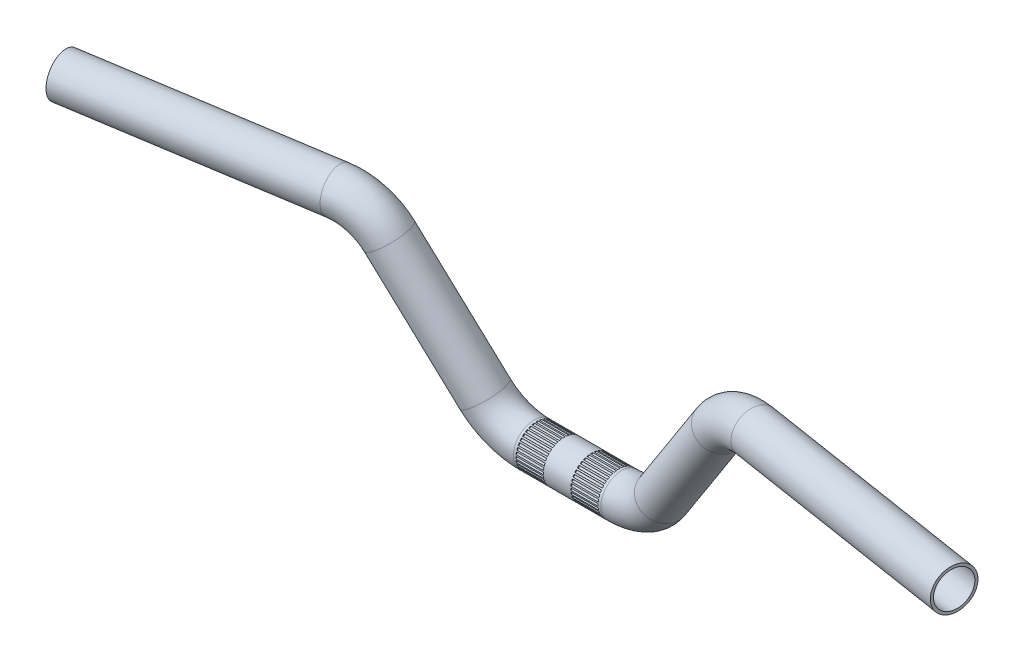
from build123d import *

# Parameters (mm, degrees)
SKETCH4_R                = 19
SKETCH4_R_2              = 16.5
CUT_EXTRUDE1_START       = 12.5
SKETCH11_R               = 1
CUT_EXTRUDE1_DEPTH       = 25
CIRPATTERN1_COUNT        = 36
MIRROR2_START            = 12.5
MIRROR2_COPY_1_SKETCH_R  = 1
MIRROR2_COPY_1_DEPTH     = 25
MIRROR2_COPY_2_SKETCH_R  = 1
MIRROR2_COPY_2_DEPTH     = 25
MIRROR2_COPY_3_SKETCH_R  = 1
MIRROR2_COPY_3_DEPTH     = 25
MIRROR2_COPY_4_SKETCH_R  = 1
MIRROR2_COPY_4_DEPTH     = 25
MIRROR2_COPY_5_SKETCH_R  = 1
MIRROR2_COPY_5_DEPTH     = 25
MIRROR2_COPY_6_SKETCH_R  = 1
MIRROR2_COPY_6_DEPTH     = 25
MIRROR2_COPY_7_SKETCH_R  = 1
MIRROR2_COPY_7_DEPTH     = 25
MIRROR2_COPY_8_SKETCH_R  = 1
MIRROR2_COPY_8_DEPTH     = 25
MIRROR2_COPY_9_SKETCH_R  = 1
MIRROR2_COPY_9_DEPTH     = 25
MIRROR2_COPY_10_SKETCH_R = 1
MIRROR2_COPY_10_DEPTH    = 25
MIRROR2_COPY_11_SKETCH_R = 1
MIRROR2_COPY_11_DEPTH    = 25
MIRROR2_COPY_12_SKETCH_R = 1
MIRROR2_COPY_12_DEPTH    = 25
MIRROR2_COPY_13_SKETCH_R = 1
MIRROR2_COPY_13_DEPTH    = 25
MIRROR2_COPY_14_SKETCH_R = 1
MIRROR2_COPY_14_DEPTH    = 25
MIRROR2_COPY_15_SKETCH_R = 1
MIRROR2_COPY_15_DEPTH    = 25
MIRROR2_COPY_16_SKETCH_R = 1
MIRROR2_COPY_16_DEPTH    = 25
MIRROR2_COPY_17_SKETCH_R = 1
MIRROR2_COPY_17_DEPTH    = 25
MIRROR2_COPY_18_SKETCH_R = 1
MIRROR2_COPY_18_DEPTH    = 25
MIRROR2_COPY_19_SKETCH_R = 1
MIRROR2_COPY_19_DEPTH    = 25
MIRROR2_COPY_20_SKETCH_R = 1
MIRROR2_COPY_20_DEPTH    = 25
MIRROR2_COPY_21_SKETCH_R = 1
MIRROR2_COPY_21_DEPTH    = 25
MIRROR2_COPY_22_SKETCH_R = 1
MIRROR2_COPY_22_DEPTH    = 25
MIRROR2_COPY_23_SKETCH_R = 1
MIRROR2_COPY_23_DEPTH    = 25
MIRROR2_COPY_24_SKETCH_R = 1
MIRROR2_COPY_24_DEPTH    = 25
MIRROR2_COPY_25_SKETCH_R = 1
MIRROR2_COPY_25_DEPTH    = 25
MIRROR2_COPY_26_SKETCH_R = 1
MIRROR2_COPY_26_DEPTH    = 25
MIRROR2_COPY_27_SKETCH_R = 1
MIRROR2_COPY_27_DEPTH    = 25
MIRROR2_COPY_28_SKETCH_R = 1
MIRROR2_COPY_28_DEPTH    = 25
MIRROR2_COPY_29_SKETCH_R = 1
MIRROR2_COPY_29_DEPTH    = 25
MIRROR2_COPY_30_SKETCH_R = 1
MIRROR2_COPY_30_DEPTH    = 25
MIRROR2_COPY_31_SKETCH_R = 1
MIRROR2_COPY_31_DEPTH    = 25
MIRROR2_COPY_32_SKETCH_R = 1
MIRROR2_COPY_32_DEPTH    = 25
MIRROR2_COPY_33_SKETCH_R = 1
MIRROR2_COPY_33_DEPTH    = 25
MIRROR2_COPY_34_SKETCH_R = 1
MIRROR2_COPY_34_DEPTH    = 25
MIRROR2_COPY_35_SKETCH_R = 1
MIRROR2_COPY_35_DEPTH    = 25


with BuildPart() as part:
    # Sweep-Thin1: sweep along a curve in space
    with BuildLine() as sweep_thin1_path:
        Line((0, 0, 0), (39.884500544, 0, 0))
        ThreePointArc((80.920548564, 21.099765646, 3.767815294), (63.032685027, 5.592668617, 0.998690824), (39.884500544, 0, 0))
        Line((80.920548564, 21.099765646, 3.767815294), (150.423374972, 119.386590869, 21.319034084))
        ThreePointArc((190.202166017, 140, 28.973785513), (167.809892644, 134.548845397, 25.07743527), (150.423374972, 119.386590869, 21.319034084))
        Line((190.202166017, 140, 28.973785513), (406, 140, 63))
    # Sketch4 → Sweep-Thin1 (sweep)
    with BuildSketch(Plane(origin=(0, 0, 0), x_dir=(0, 0, -1), z_dir=(1, 0, 0))):
        Circle(SKETCH4_R)
        Circle(SKETCH4_R_2, mode=Mode.SUBTRACT)
    sweep_thin1 = sweep(path=sweep_thin1_path.line)

    # Mirror1: Sweep-Thin1 across plane
    add(sweep_thin1.mirror(Plane(origin=(0, 0, 0), x_dir=(0, 0, 1), z_dir=(1, 0, 0))))

    # Sketch11 → Cut-Extrude1 (cut)
    with BuildSketch(Plane(origin=(0, 0, 0), x_dir=(0, 0, -1), z_dir=(1, 0, 0)).offset(CUT_EXTRUDE1_START)):
        with Locations((0, -19)):
            Circle(SKETCH11_R)
    cut_extrude1 = extrude(amount=CUT_EXTRUDE1_DEPTH, mode=Mode.SUBTRACT)

    # CirPattern1: Cut-Extrude1 ×36 about axis
    cirpattern1_axis = Axis((0, 0, 0), (1, 0, 0))
    for i in range(1, CIRPATTERN1_COUNT):
        add(cut_extrude1.rotate(cirpattern1_axis, i * 360 / CIRPATTERN1_COUNT), mode=Mode.SUBTRACT)

    # Mirror2: Cut-Extrude1 across plane
    add(cut_extrude1.mirror(Plane(origin=(0, 0, 0), x_dir=(0, 0, 1), z_dir=(1, 0, 0))), mode=Mode.SUBTRACT)

    # Mirror2 copy 1 sketch → Mirror2 copy 1 (cut)
    with BuildSketch(Plane(origin=(0, 0, 0), x_dir=(0, 0.17364817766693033, -0.984807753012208), z_dir=(-1, 0, 0)).offset(MIRROR2_START)):
        with Locations((0, 19)):
            Circle(MIRROR2_COPY_1_SKETCH_R)
    extrude(amount=MIRROR2_COPY_1_DEPTH, mode=Mode.SUBTRACT)

    # Mirror2 copy 2 sketch → Mirror2 copy 2 (cut)
    with BuildSketch(Plane(origin=(0, 0, 0), x_dir=(0, 0.3420201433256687, -0.9396926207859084), z_dir=(-1, 0, 0)).offset(MIRROR2_START)):
        with Locations((0, 19)):
            Circle(MIRROR2_COPY_2_SKETCH_R)
    extrude(amount=MIRROR2_COPY_2_DEPTH, mode=Mode.SUBTRACT)

    # Mirror2 copy 3 sketch → Mirror2 copy 3 (cut)
    with BuildSketch(Plane(origin=(0, 0, 0), x_dir=(0, 0.49999999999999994, -0.8660254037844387), z_dir=(-1, 0, 0)).offset(MIRROR2_START)):
        with Locations((0, 19)):
            Circle(MIRROR2_COPY_3_SKETCH_R)
    extrude(amount=MIRROR2_COPY_3_DEPTH, mode=Mode.SUBTRACT)

    # Mirror2 copy 4 sketch → Mirror2 copy 4 (cut)
    with BuildSketch(Plane(origin=(0, 0, 0), x_dir=(0, 0.6427876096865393, -0.766044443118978), z_dir=(-1, 0, 0)).offset(MIRROR2_START)):
        with Locations((0, 19)):
            Circle(MIRROR2_COPY_4_SKETCH_R)
    extrude(amount=MIRROR2_COPY_4_DEPTH, mode=Mode.SUBTRACT)

    # Mirror2 copy 5 sketch → Mirror2 copy 5 (cut)
    with BuildSketch(Plane(origin=(0, 0, 0), x_dir=(0, 0.766044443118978, -0.6427876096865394), z_dir=(-1, 0, 0)).offset(MIRROR2_START)):
        with Locations((0, 19)):
            Circle(MIRROR2_COPY_5_SKETCH_R)
    extrude(amount=MIRROR2_COPY_5_DEPTH, mode=Mode.SUBTRACT)

    # Mirror2 copy 6 sketch → Mirror2 copy 6 (cut)
    with BuildSketch(Plane(origin=(0, 0, 0), x_dir=(0, 0.8660254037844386, -0.5000000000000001), z_dir=(-1, 0, 0)).offset(MIRROR2_START)):
        with Locations((0, 19)):
            Circle(MIRROR2_COPY_6_SKETCH_R)
    extrude(amount=MIRROR2_COPY_6_DEPTH, mode=Mode.SUBTRACT)

    # Mirror2 copy 7 sketch → Mirror2 copy 7 (cut)
    with BuildSketch(Plane(origin=(0, 0, 0), x_dir=(0, 0.9396926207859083, -0.3420201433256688), z_dir=(-1, 0, 0)).offset(MIRROR2_START)):
        with Locations((0, 19)):
            Circle(MIRROR2_COPY_7_SKETCH_R)
    extrude(amount=MIRROR2_COPY_7_DEPTH, mode=Mode.SUBTRACT)

    # Mirror2 copy 8 sketch → Mirror2 copy 8 (cut)
    with BuildSketch(Plane(origin=(0, 0, 0), x_dir=(0, 0.984807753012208, -0.17364817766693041), z_dir=(-1, 0, 0)).offset(MIRROR2_START)):
        with Locations((0, 19)):
            Circle(MIRROR2_COPY_8_SKETCH_R)
    extrude(amount=MIRROR2_COPY_8_DEPTH, mode=Mode.SUBTRACT)

    # Mirror2 copy 9 sketch → Mirror2 copy 9 (cut)
    with BuildSketch(Plane(origin=(0, 0, 0), x_dir=(0, 1, 0), z_dir=(-1, 0, 0)).offset(MIRROR2_START)):
        with Locations((0, 19)):
            Circle(MIRROR2_COPY_9_SKETCH_R)
    extrude(amount=MIRROR2_COPY_9_DEPTH, mode=Mode.SUBTRACT)

    # Mirror2 copy 10 sketch → Mirror2 copy 10 (cut)
    with BuildSketch(Plane(origin=(0, 0, 0), x_dir=(0, 0.984807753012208, 0.1736481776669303), z_dir=(-1, 0, 0)).offset(MIRROR2_START)):
        with Locations((0, 19)):
            Circle(MIRROR2_COPY_10_SKETCH_R)
    extrude(amount=MIRROR2_COPY_10_DEPTH, mode=Mode.SUBTRACT)

    # Mirror2 copy 11 sketch → Mirror2 copy 11 (cut)
    with BuildSketch(Plane(origin=(0, 0, 0), x_dir=(0, 0.9396926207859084, 0.3420201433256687), z_dir=(-1, 0, 0)).offset(MIRROR2_START)):
        with Locations((0, 19)):
            Circle(MIRROR2_COPY_11_SKETCH_R)
    extrude(amount=MIRROR2_COPY_11_DEPTH, mode=Mode.SUBTRACT)

    # Mirror2 copy 12 sketch → Mirror2 copy 12 (cut)
    with BuildSketch(Plane(origin=(0, 0, 0), x_dir=(0, 0.8660254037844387, 0.4999999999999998), z_dir=(-1, 0, 0)).offset(MIRROR2_START)):
        with Locations((0, 19)):
            Circle(MIRROR2_COPY_12_SKETCH_R)
    extrude(amount=MIRROR2_COPY_12_DEPTH, mode=Mode.SUBTRACT)

    # Mirror2 copy 13 sketch → Mirror2 copy 13 (cut)
    with BuildSketch(Plane(origin=(0, 0, 0), x_dir=(0, 0.766044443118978, 0.6427876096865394), z_dir=(-1, 0, 0)).offset(MIRROR2_START)):
        with Locations((0, 19)):
            Circle(MIRROR2_COPY_13_SKETCH_R)
    extrude(amount=MIRROR2_COPY_13_DEPTH, mode=Mode.SUBTRACT)

    # Mirror2 copy 14 sketch → Mirror2 copy 14 (cut)
    with BuildSketch(Plane(origin=(0, 0, 0), x_dir=(0, 0.6427876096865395, 0.7660444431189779), z_dir=(-1, 0, 0)).offset(MIRROR2_START)):
        with Locations((0, 19)):
            Circle(MIRROR2_COPY_14_SKETCH_R)
    extrude(amount=MIRROR2_COPY_14_DEPTH, mode=Mode.SUBTRACT)

    # Mirror2 copy 15 sketch → Mirror2 copy 15 (cut)
    with BuildSketch(Plane(origin=(0, 0, 0), x_dir=(0, 0.49999999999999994, 0.8660254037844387), z_dir=(-1, 0, 0)).offset(MIRROR2_START)):
        with Locations((0, 19)):
            Circle(MIRROR2_COPY_15_SKETCH_R)
    extrude(amount=MIRROR2_COPY_15_DEPTH, mode=Mode.SUBTRACT)

    # Mirror2 copy 16 sketch → Mirror2 copy 16 (cut)
    with BuildSketch(Plane(origin=(0, 0, 0), x_dir=(0, 0.3420201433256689, 0.9396926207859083), z_dir=(-1, 0, 0)).offset(MIRROR2_START)):
        with Locations((0, 19)):
            Circle(MIRROR2_COPY_16_SKETCH_R)
    extrude(amount=MIRROR2_COPY_16_DEPTH, mode=Mode.SUBTRACT)

    # Mirror2 copy 17 sketch → Mirror2 copy 17 (cut)
    with BuildSketch(Plane(origin=(0, 0, 0), x_dir=(0, 0.17364817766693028, 0.984807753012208), z_dir=(-1, 0, 0)).offset(MIRROR2_START)):
        with Locations((0, 19)):
            Circle(MIRROR2_COPY_17_SKETCH_R)
    extrude(amount=MIRROR2_COPY_17_DEPTH, mode=Mode.SUBTRACT)

    # Mirror2 copy 18 sketch → Mirror2 copy 18 (cut)
    with BuildSketch(Plane.ZY.offset(MIRROR2_START)):
        with Locations((0, 19)):
            Circle(MIRROR2_COPY_18_SKETCH_R)
    extrude(amount=MIRROR2_COPY_18_DEPTH, mode=Mode.SUBTRACT)

    # Mirror2 copy 19 sketch → Mirror2 copy 19 (cut)
    with BuildSketch(Plane(origin=(0, 0, 0), x_dir=(0, -0.17364817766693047, 0.984807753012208), z_dir=(-1, 0, 0)).offset(MIRROR2_START)):
        with Locations((0, 19)):
            Circle(MIRROR2_COPY_19_SKETCH_R)
    extrude(amount=MIRROR2_COPY_19_DEPTH, mode=Mode.SUBTRACT)

    # Mirror2 copy 20 sketch → Mirror2 copy 20 (cut)
    with BuildSketch(Plane(origin=(0, 0, 0), x_dir=(0, -0.34202014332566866, 0.9396926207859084), z_dir=(-1, 0, 0)).offset(MIRROR2_START)):
        with Locations((0, 19)):
            Circle(MIRROR2_COPY_20_SKETCH_R)
    extrude(amount=MIRROR2_COPY_20_DEPTH, mode=Mode.SUBTRACT)

    # Mirror2 copy 21 sketch → Mirror2 copy 21 (cut)
    with BuildSketch(Plane(origin=(0, 0, 0), x_dir=(0, -0.5000000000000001, 0.8660254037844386), z_dir=(-1, 0, 0)).offset(MIRROR2_START)):
        with Locations((0, 19)):
            Circle(MIRROR2_COPY_21_SKETCH_R)
    extrude(amount=MIRROR2_COPY_21_DEPTH, mode=Mode.SUBTRACT)

    # Mirror2 copy 22 sketch → Mirror2 copy 22 (cut)
    with BuildSketch(Plane(origin=(0, 0, 0), x_dir=(0, -0.6427876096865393, 0.766044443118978), z_dir=(-1, 0, 0)).offset(MIRROR2_START)):
        with Locations((0, 19)):
            Circle(MIRROR2_COPY_22_SKETCH_R)
    extrude(amount=MIRROR2_COPY_22_DEPTH, mode=Mode.SUBTRACT)

    # Mirror2 copy 23 sketch → Mirror2 copy 23 (cut)
    with BuildSketch(Plane(origin=(0, 0, 0), x_dir=(0, -0.7660444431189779, 0.6427876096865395), z_dir=(-1, 0, 0)).offset(MIRROR2_START)):
        with Locations((0, 19)):
            Circle(MIRROR2_COPY_23_SKETCH_R)
    extrude(amount=MIRROR2_COPY_23_DEPTH, mode=Mode.SUBTRACT)

    # Mirror2 copy 24 sketch → Mirror2 copy 24 (cut)
    with BuildSketch(Plane(origin=(0, 0, 0), x_dir=(0, -0.8660254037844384, 0.5000000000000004), z_dir=(-1, 0, 0)).offset(MIRROR2_START)):
        with Locations((0, 19)):
            Circle(MIRROR2_COPY_24_SKETCH_R)
    extrude(amount=MIRROR2_COPY_24_DEPTH, mode=Mode.SUBTRACT)

    # Mirror2 copy 25 sketch → Mirror2 copy 25 (cut)
    with BuildSketch(Plane(origin=(0, 0, 0), x_dir=(0, -0.9396926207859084, 0.34202014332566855), z_dir=(-1, 0, 0)).offset(MIRROR2_START)):
        with Locations((0, 19)):
            Circle(MIRROR2_COPY_25_SKETCH_R)
    extrude(amount=MIRROR2_COPY_25_DEPTH, mode=Mode.SUBTRACT)

    # Mirror2 copy 26 sketch → Mirror2 copy 26 (cut)
    with BuildSketch(Plane(origin=(0, 0, 0), x_dir=(0, -0.984807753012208, 0.17364817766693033), z_dir=(-1, 0, 0)).offset(MIRROR2_START)):
        with Locations((0, 19)):
            Circle(MIRROR2_COPY_26_SKETCH_R)
    extrude(amount=MIRROR2_COPY_26_DEPTH, mode=Mode.SUBTRACT)

    # Mirror2 copy 27 sketch → Mirror2 copy 27 (cut)
    with BuildSketch(Plane(origin=(0, 0, 0), x_dir=(0, -1, 0), z_dir=(-1, 0, 0)).offset(MIRROR2_START)):
        with Locations((0, 19)):
            Circle(MIRROR2_COPY_27_SKETCH_R)
    extrude(amount=MIRROR2_COPY_27_DEPTH, mode=Mode.SUBTRACT)

    # Mirror2 copy 28 sketch → Mirror2 copy 28 (cut)
    with BuildSketch(Plane(origin=(0, 0, 0), x_dir=(0, -0.9848077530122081, -0.17364817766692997), z_dir=(-1, 0, 0)).offset(MIRROR2_START)):
        with Locations((0, 19)):
            Circle(MIRROR2_COPY_28_SKETCH_R)
    extrude(amount=MIRROR2_COPY_28_DEPTH, mode=Mode.SUBTRACT)

    # Mirror2 copy 29 sketch → Mirror2 copy 29 (cut)
    with BuildSketch(Plane(origin=(0, 0, 0), x_dir=(0, -0.9396926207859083, -0.342020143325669), z_dir=(-1, 0, 0)).offset(MIRROR2_START)):
        with Locations((0, 19)):
            Circle(MIRROR2_COPY_29_SKETCH_R)
    extrude(amount=MIRROR2_COPY_29_DEPTH, mode=Mode.SUBTRACT)

    # Mirror2 copy 30 sketch → Mirror2 copy 30 (cut)
    with BuildSketch(Plane(origin=(0, 0, 0), x_dir=(0, -0.8660254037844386, -0.5000000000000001), z_dir=(-1, 0, 0)).offset(MIRROR2_START)):
        with Locations((0, 19)):
            Circle(MIRROR2_COPY_30_SKETCH_R)
    extrude(amount=MIRROR2_COPY_30_DEPTH, mode=Mode.SUBTRACT)

    # Mirror2 copy 31 sketch → Mirror2 copy 31 (cut)
    with BuildSketch(Plane(origin=(0, 0, 0), x_dir=(0, -0.7660444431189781, -0.6427876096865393), z_dir=(-1, 0, 0)).offset(MIRROR2_START)):
        with Locations((0, 19)):
            Circle(MIRROR2_COPY_31_SKETCH_R)
    extrude(amount=MIRROR2_COPY_31_DEPTH, mode=Mode.SUBTRACT)

    # Mirror2 copy 32 sketch → Mirror2 copy 32 (cut)
    with BuildSketch(Plane(origin=(0, 0, 0), x_dir=(0, -0.6427876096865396, -0.7660444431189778), z_dir=(-1, 0, 0)).offset(MIRROR2_START)):
        with Locations((0, 19)):
            Circle(MIRROR2_COPY_32_SKETCH_R)
    extrude(amount=MIRROR2_COPY_32_DEPTH, mode=Mode.SUBTRACT)

    # Mirror2 copy 33 sketch → Mirror2 copy 33 (cut)
    with BuildSketch(Plane(origin=(0, 0, 0), x_dir=(0, -0.5000000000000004, -0.8660254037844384), z_dir=(-1, 0, 0)).offset(MIRROR2_START)):
        with Locations((0, 19)):
            Circle(MIRROR2_COPY_33_SKETCH_R)
    extrude(amount=MIRROR2_COPY_33_DEPTH, mode=Mode.SUBTRACT)

    # Mirror2 copy 34 sketch → Mirror2 copy 34 (cut)
    with BuildSketch(Plane(origin=(0, 0, 0), x_dir=(0, -0.3420201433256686, -0.9396926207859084), z_dir=(-1, 0, 0)).offset(MIRROR2_START)):
        with Locations((0, 19)):
            Circle(MIRROR2_COPY_34_SKETCH_R)
    extrude(amount=MIRROR2_COPY_34_DEPTH, mode=Mode.SUBTRACT)

    # Mirror2 copy 35 sketch → Mirror2 copy 35 (cut)
    with BuildSketch(Plane(origin=(0, 0, 0), x_dir=(0, -0.1736481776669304, -0.984807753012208), z_dir=(-1, 0, 0)).offset(MIRROR2_START)):
        with Locations((0, 19)):
            Circle(MIRROR2_COPY_35_SKETCH_R)
    extrude(amount=MIRROR2_COPY_35_DEPTH, mode=Mode.SUBTRACT)


solid = part.part
